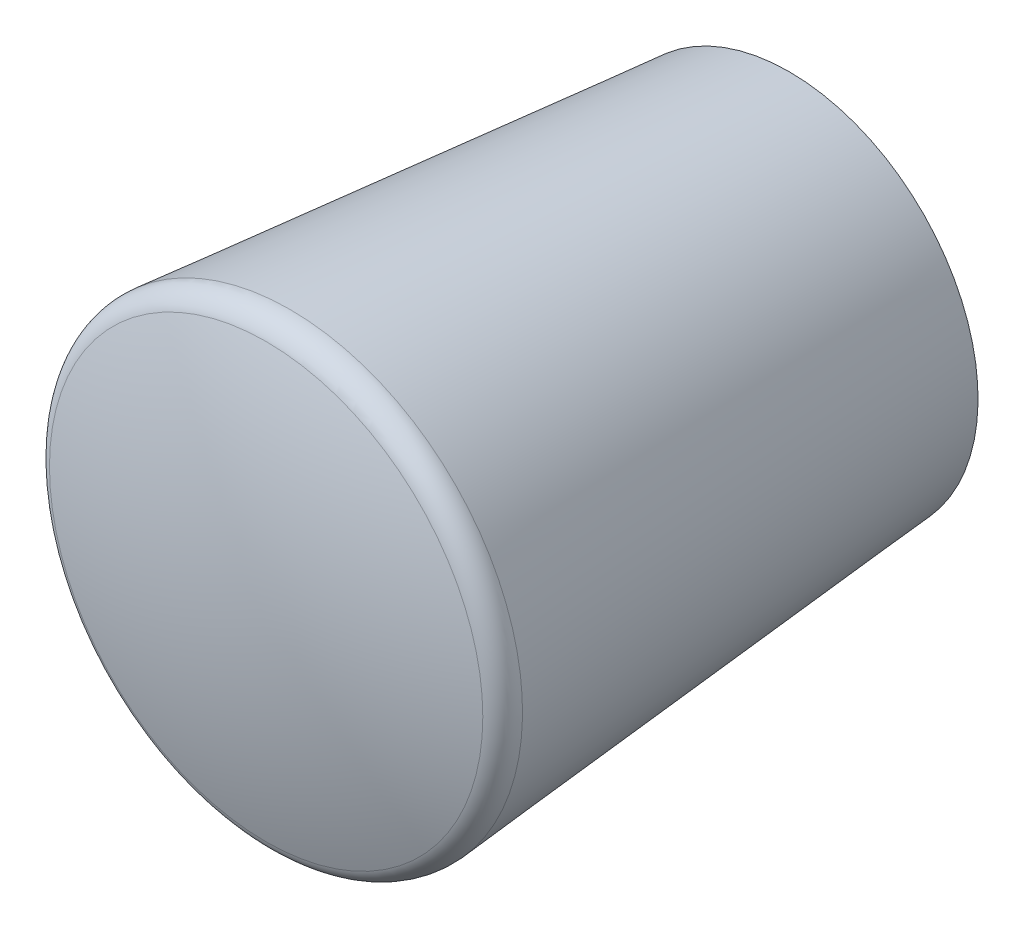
ISO-10303-21;
HEADER;
FILE_DESCRIPTION(('STEP AP214'),'2;1');
FILE_NAME('part.step','',(''),(''),'','','');
FILE_SCHEMA(('AUTOMOTIVE_DESIGN { 1 0 10303 214 1 1 1 1 }'));
ENDSEC;
DATA;
#1=APPLICATION_CONTEXT('core data for automotive mechanical design processes');
#2=APPLICATION_PROTOCOL_DEFINITION('international standard','automotive_design',2000,#1);
#3=PRODUCT_CONTEXT('',#1,'mechanical');
#4=PRODUCT('Part','Part','',(#3));
#5=PRODUCT_RELATED_PRODUCT_CATEGORY('part','',(#4));
#6=PRODUCT_DEFINITION_FORMATION('','',#4);
#7=PRODUCT_DEFINITION_CONTEXT('part definition',#1,'design');
#8=PRODUCT_DEFINITION('design','',#6,#7);
#9=PRODUCT_DEFINITION_SHAPE('','',#8);
#10=(LENGTH_UNIT() NAMED_UNIT(*) SI_UNIT(.MILLI.,.METRE.));
#11=(NAMED_UNIT(*) PLANE_ANGLE_UNIT() SI_UNIT($,.RADIAN.));
#12=(NAMED_UNIT(*) SI_UNIT($,.STERADIAN.) SOLID_ANGLE_UNIT());
#13=UNCERTAINTY_MEASURE_WITH_UNIT(LENGTH_MEASURE(1.E-05),#10,'distance_accuracy_value','');
#14=(GEOMETRIC_REPRESENTATION_CONTEXT(3) GLOBAL_UNCERTAINTY_ASSIGNED_CONTEXT((#13)) GLOBAL_UNIT_ASSIGNED_CONTEXT((#10,
#11,#12)) REPRESENTATION_CONTEXT('',''));
#15=CARTESIAN_POINT('',(0.,0.,0.));
#16=DIRECTION('',(0.,0.,1.));
#17=DIRECTION('',(1.,0.,0.));
#18=AXIS2_PLACEMENT_3D('',#15,#16,#17);
#19=CARTESIAN_POINT('',(4.,0.,15.));
#20=DIRECTION('',(0.,0.,-1.));
#21=DIRECTION('',(0.,1.,0.));
#22=AXIS2_PLACEMENT_3D('',#19,#20,#21);
#23=PLANE('',#22);
#24=CARTESIAN_POINT('',(0.,0.,15.));
#25=DIRECTION('',(0.,0.,-1.));
#26=DIRECTION('',(0.,1.,0.));
#27=AXIS2_PLACEMENT_3D('',#24,#25,#26);
#28=CIRCLE('',#27,4.);
#29=CARTESIAN_POINT('',(0.,4.,15.));
#30=VERTEX_POINT('',#29);
#31=EDGE_CURVE('E8',#30,#30,#28,.T.);
#32=ORIENTED_EDGE('',*,*,#31,.T.);
#33=EDGE_LOOP('',(#32));
#34=FACE_BOUND('',#33,.T.);
#35=ADVANCED_FACE('F12',(#34),#23,.T.);
#36=CARTESIAN_POINT('',(0.,0.,0.));
#37=DIRECTION('',(0.,0.,-1.));
#38=DIRECTION('',(0.,1.,0.));
#39=AXIS2_PLACEMENT_3D('',#36,#37,#38);
#40=CYLINDRICAL_SURFACE('',#39,4.);
#41=CARTESIAN_POINT('',(0.,0.,0.));
#42=DIRECTION('',(0.,0.,-1.));
#43=DIRECTION('',(0.,1.,0.));
#44=AXIS2_PLACEMENT_3D('',#41,#42,#43);
#45=CIRCLE('',#44,4.);
#46=CARTESIAN_POINT('',(0.,4.,0.));
#47=VERTEX_POINT('',#46);
#48=EDGE_CURVE('E18',#47,#47,#45,.T.);
#49=ORIENTED_EDGE('',*,*,#48,.T.);
#50=EDGE_LOOP('',(#49));
#51=FACE_BOUND('',#50,.T.);
#52=ORIENTED_EDGE('',*,*,#31,.F.);
#53=EDGE_LOOP('',(#52));
#54=FACE_BOUND('',#53,.T.);
#55=ADVANCED_FACE('F52',(#51,#54),#40,.F.);
#56=CARTESIAN_POINT('',(4.,0.,0.));
#57=DIRECTION('',(0.,0.,-1.));
#58=DIRECTION('',(0.,1.,0.));
#59=AXIS2_PLACEMENT_3D('',#56,#57,#58);
#60=PLANE('',#59);
#61=CARTESIAN_POINT('',(0.,0.,0.));
#62=DIRECTION('',(0.,0.,-1.));
#63=DIRECTION('',(0.,1.,0.));
#64=AXIS2_PLACEMENT_3D('',#61,#62,#63);
#65=CIRCLE('',#64,5.);
#66=CARTESIAN_POINT('',(0.,5.,0.));
#67=VERTEX_POINT('',#66);
#68=EDGE_CURVE('E22',#67,#67,#65,.T.);
#69=ORIENTED_EDGE('',*,*,#68,.T.);
#70=EDGE_LOOP('',(#69));
#71=FACE_BOUND('',#70,.T.);
#72=ORIENTED_EDGE('',*,*,#48,.F.);
#73=EDGE_LOOP('',(#72));
#74=FACE_BOUND('',#73,.T.);
#75=ADVANCED_FACE('F57',(#71,#74),#60,.T.);
#76=CARTESIAN_POINT('',(0.,0.,0.));
#77=DIRECTION('',(0.,0.,1.));
#78=DIRECTION('',(0.,-1.,0.));
#79=AXIS2_PLACEMENT_3D('',#76,#77,#78);
#80=CONICAL_SURFACE('',#79,5.,1.0471975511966);
#81=CARTESIAN_POINT('',(0.,0.,1.83443525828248));
#82=DIRECTION('',(0.,0.,-1.));
#83=DIRECTION('',(0.,1.,0.));
#84=AXIS2_PLACEMENT_3D('',#81,#82,#83);
#85=CIRCLE('',#84,8.17733507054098);
#86=CARTESIAN_POINT('',(0.,8.17733507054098,1.83443525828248));
#87=VERTEX_POINT('',#86);
#88=EDGE_CURVE('E26',#87,#87,#85,.T.);
#89=ORIENTED_EDGE('',*,*,#88,.T.);
#90=EDGE_LOOP('',(#89));
#91=FACE_BOUND('',#90,.T.);
#92=ORIENTED_EDGE('',*,*,#68,.F.);
#93=EDGE_LOOP('',(#92));
#94=FACE_BOUND('',#93,.T.);
#95=ADVANCED_FACE('F62',(#91,#94),#80,.T.);
#96=CARTESIAN_POINT('',(0.,0.,1.83443525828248));
#97=DIRECTION('',(0.,0.,1.));
#98=DIRECTION('',(0.,-1.,0.));
#99=AXIS2_PLACEMENT_3D('',#96,#97,#98);
#100=CONICAL_SURFACE('',#99,8.17733507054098,0.0872664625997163);
#101=CARTESIAN_POINT('',(0.,0.,23.457044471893));
#102=DIRECTION('',(0.,0.,-1.));
#103=DIRECTION('',(0.,1.,0.));
#104=AXIS2_PLACEMENT_3D('',#101,#102,#103);
#105=CIRCLE('',#104,10.0690682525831);
#106=CARTESIAN_POINT('',(0.,10.0690682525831,23.457044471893));
#107=VERTEX_POINT('',#106);
#108=EDGE_CURVE('E31',#107,#107,#105,.T.);
#109=ORIENTED_EDGE('',*,*,#108,.T.);
#110=EDGE_LOOP('',(#109));
#111=FACE_BOUND('',#110,.T.);
#112=ORIENTED_EDGE('',*,*,#88,.F.);
#113=EDGE_LOOP('',(#112));
#114=FACE_BOUND('',#113,.T.);
#115=ADVANCED_FACE('F49',(#111,#114),#100,.T.);
#116=CARTESIAN_POINT('',(0.,0.,23.5442002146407));
#117=DIRECTION('',(0.,0.,-1.));
#118=DIRECTION('',(0.,1.,0.));
#119=AXIS2_PLACEMENT_3D('',#116,#117,#118);
#120=TOROIDAL_SURFACE('',#119,9.07287355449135,1.);
#121=CARTESIAN_POINT('',(0.,0.,24.4940002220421));
#122=DIRECTION('',(0.,0.,-1.));
#123=DIRECTION('',(0.,1.,0.));
#124=AXIS2_PLACEMENT_3D('',#121,#122,#123);
#125=CIRCLE('',#124,9.38573126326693);
#126=CARTESIAN_POINT('',(0.,9.38573126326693,24.4940002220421));
#127=VERTEX_POINT('',#126);
#128=EDGE_CURVE('E34',#127,#127,#125,.T.);
#129=ORIENTED_EDGE('',*,*,#128,.T.);
#130=EDGE_LOOP('',(#129));
#131=FACE_BOUND('',#130,.T.);
#132=ORIENTED_EDGE('',*,*,#108,.F.);
#133=EDGE_LOOP('',(#132));
#134=FACE_BOUND('',#133,.T.);
#135=ADVANCED_FACE('F38',(#131,#134),#120,.T.);
#136=CARTESIAN_POINT('',(0.,0.,-4.));
#137=DIRECTION('',(0.,0.,-1.));
#138=DIRECTION('',(1.,0.,0.));
#139=AXIS2_PLACEMENT_3D('',#136,#137,#138);
#140=SPHERICAL_SURFACE('',#139,30.);
#141=ORIENTED_EDGE('',*,*,#128,.F.);
#142=EDGE_LOOP('',(#141));
#143=FACE_BOUND('',#142,.T.);
#144=ADVANCED_FACE('F41',(#143),#140,.T.);
#145=CLOSED_SHELL('',(#35,#55,#75,#95,#115,#135,#144));
#146=MANIFOLD_SOLID_BREP('B1',#145);
#147=ADVANCED_BREP_SHAPE_REPRESENTATION('',(#18,#146),#14);
#148=SHAPE_DEFINITION_REPRESENTATION(#9,#147);
ENDSEC;
END-ISO-10303-21;
